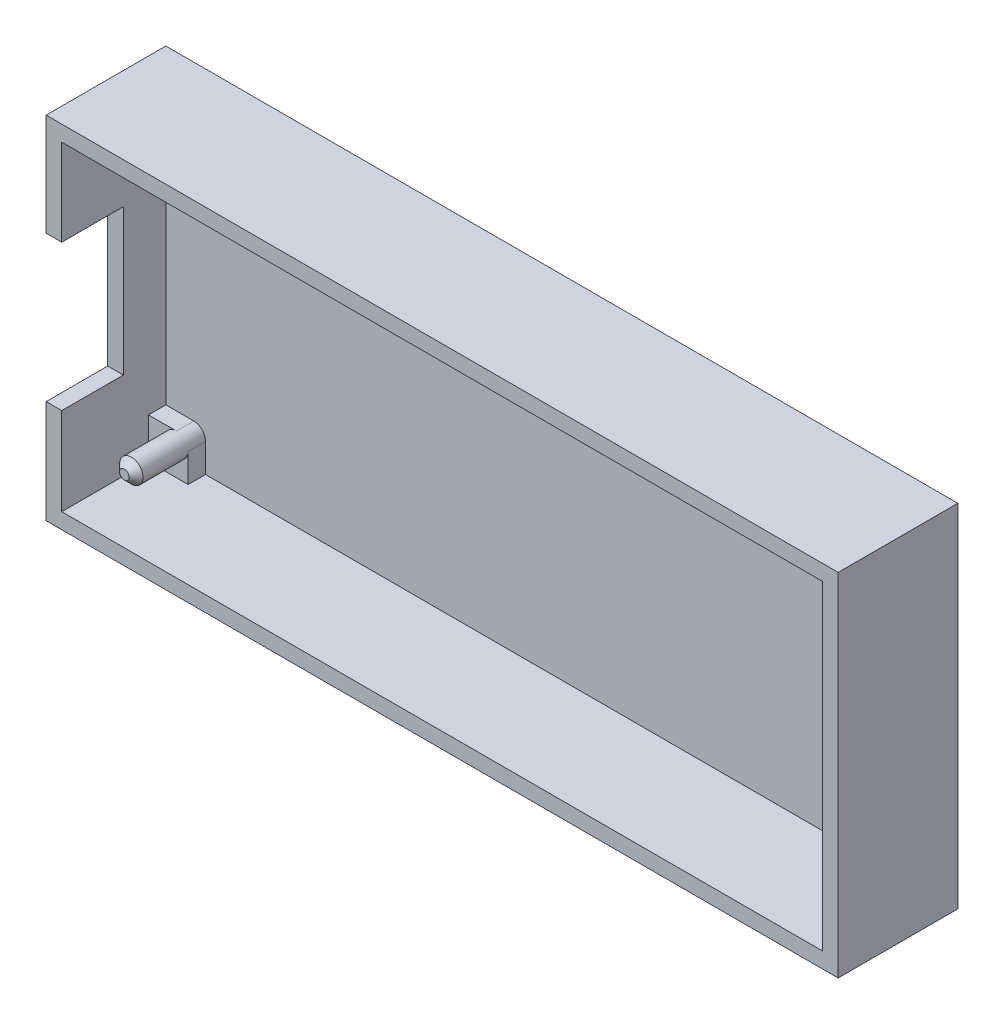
ISO-10303-21;
HEADER;
FILE_DESCRIPTION(('STEP AP214'),'2;1');
FILE_NAME('part.step','',(''),(''),'','','');
FILE_SCHEMA(('AUTOMOTIVE_DESIGN { 1 0 10303 214 1 1 1 1 }'));
ENDSEC;
DATA;
#1=APPLICATION_CONTEXT('core data for automotive mechanical design processes');
#2=APPLICATION_PROTOCOL_DEFINITION('international standard','automotive_design',2000,#1);
#3=PRODUCT_CONTEXT('',#1,'mechanical');
#4=PRODUCT('Part','Part','',(#3));
#5=PRODUCT_RELATED_PRODUCT_CATEGORY('part','',(#4));
#6=PRODUCT_DEFINITION_FORMATION('','',#4);
#7=PRODUCT_DEFINITION_CONTEXT('part definition',#1,'design');
#8=PRODUCT_DEFINITION('design','',#6,#7);
#9=PRODUCT_DEFINITION_SHAPE('','',#8);
#10=(LENGTH_UNIT() NAMED_UNIT(*) SI_UNIT(.MILLI.,.METRE.));
#11=(NAMED_UNIT(*) PLANE_ANGLE_UNIT() SI_UNIT($,.RADIAN.));
#12=(NAMED_UNIT(*) SI_UNIT($,.STERADIAN.) SOLID_ANGLE_UNIT());
#13=UNCERTAINTY_MEASURE_WITH_UNIT(LENGTH_MEASURE(1.E-05),#10,'distance_accuracy_value','');
#14=(GEOMETRIC_REPRESENTATION_CONTEXT(3) GLOBAL_UNCERTAINTY_ASSIGNED_CONTEXT((#13)) GLOBAL_UNIT_ASSIGNED_CONTEXT((#10,
#11,#12)) REPRESENTATION_CONTEXT('',''));
#15=CARTESIAN_POINT('',(0.,0.,0.));
#16=DIRECTION('',(0.,0.,1.));
#17=DIRECTION('',(1.,0.,0.));
#18=AXIS2_PLACEMENT_3D('',#15,#16,#17);
#19=CARTESIAN_POINT('',(0.776564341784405,0.0262590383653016,-0.9));
#20=DIRECTION('',(0.,0.,-1.));
#21=DIRECTION('',(0.,-1.,0.));
#22=AXIS2_PLACEMENT_3D('',#19,#20,#21);
#23=PLANE('',#22);
#24=DIRECTION('',(0.,1.,0.));
#25=VECTOR('',#24,1.);
#26=CARTESIAN_POINT('',(-22.0499995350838,-10.0974817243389,-0.9));
#27=LINE('',#26,#25);
#28=CARTESIAN_POINT('',(-22.0499995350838,-10.0974817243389,-0.9));
#29=VERTEX_POINT('',#28);
#30=CARTESIAN_POINT('',(-22.0499995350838,10.1499998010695,-0.9));
#31=VERTEX_POINT('',#30);
#32=EDGE_CURVE('E11',#29,#31,#27,.T.);
#33=ORIENTED_EDGE('',*,*,#32,.T.);
#34=DIRECTION('',(1.,0.,0.));
#35=VECTOR('',#34,1.);
#36=CARTESIAN_POINT('',(-22.0499995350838,10.1499998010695,-0.9));
#37=LINE('',#36,#35);
#38=CARTESIAN_POINT('',(23.6031282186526,10.1499998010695,-0.9));
#39=VERTEX_POINT('',#38);
#40=EDGE_CURVE('E333',#31,#39,#37,.T.);
#41=ORIENTED_EDGE('',*,*,#40,.T.);
#42=DIRECTION('',(0.,-1.,0.));
#43=VECTOR('',#42,1.);
#44=CARTESIAN_POINT('',(23.6031282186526,10.1499998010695,-0.9));
#45=LINE('',#44,#43);
#46=CARTESIAN_POINT('',(23.6031282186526,-10.0974817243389,-0.9));
#47=VERTEX_POINT('',#46);
#48=EDGE_CURVE('E334',#39,#47,#45,.T.);
#49=ORIENTED_EDGE('',*,*,#48,.T.);
#50=DIRECTION('',(-1.,0.,0.));
#51=VECTOR('',#50,1.);
#52=CARTESIAN_POINT('',(23.6031282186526,-10.0974817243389,-0.9));
#53=LINE('',#52,#51);
#54=EDGE_CURVE('E398',#47,#29,#53,.T.);
#55=ORIENTED_EDGE('',*,*,#54,.T.);
#56=EDGE_LOOP('',(#33,#41,#49,#55));
#57=FACE_BOUND('',#56,.T.);
#58=ADVANCED_FACE('F17',(#57),#23,.T.);
#59=CARTESIAN_POINT('',(-22.0499995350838,-10.0974817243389,0.));
#60=DIRECTION('',(-1.,0.,0.));
#61=DIRECTION('',(0.,0.,1.));
#62=AXIS2_PLACEMENT_3D('',#59,#60,#61);
#63=PLANE('',#62);
#64=DIRECTION('',(0.,0.,1.));
#65=VECTOR('',#64,1.);
#66=CARTESIAN_POINT('',(-22.0499995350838,4.2525697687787,0.));
#67=LINE('',#66,#65);
#68=CARTESIAN_POINT('',(-22.0499995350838,4.2525697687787,2.45));
#69=VERTEX_POINT('',#68);
#70=CARTESIAN_POINT('',(-22.0499995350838,4.2525697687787,6.));
#71=VERTEX_POINT('',#70);
#72=EDGE_CURVE('E452',#69,#71,#67,.T.);
#73=ORIENTED_EDGE('',*,*,#72,.T.);
#74=DIRECTION('',(0.,-1.,0.));
#75=VECTOR('',#74,1.);
#76=CARTESIAN_POINT('',(-22.0499995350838,-10.0974817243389,6.));
#77=LINE('',#76,#75);
#78=CARTESIAN_POINT('',(-22.0499995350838,10.1499998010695,6.));
#79=VERTEX_POINT('',#78);
#80=EDGE_CURVE('E399',#79,#71,#77,.T.);
#81=ORIENTED_EDGE('',*,*,#80,.F.);
#82=DIRECTION('',(0.,0.,-1.));
#83=VECTOR('',#82,1.);
#84=CARTESIAN_POINT('',(-22.0499995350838,10.1499998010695,0.));
#85=LINE('',#84,#83);
#86=EDGE_CURVE('E28',#79,#31,#85,.T.);
#87=ORIENTED_EDGE('',*,*,#86,.T.);
#88=ORIENTED_EDGE('',*,*,#32,.F.);
#89=DIRECTION('',(0.,0.,1.));
#90=VECTOR('',#89,1.);
#91=CARTESIAN_POINT('',(-22.0499995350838,-10.0974817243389,0.));
#92=LINE('',#91,#90);
#93=CARTESIAN_POINT('',(-22.0499995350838,-10.0974817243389,6.));
#94=VERTEX_POINT('',#93);
#95=EDGE_CURVE('E395',#29,#94,#92,.T.);
#96=ORIENTED_EDGE('',*,*,#95,.T.);
#97=DIRECTION('',(0.,-1.,0.));
#98=VECTOR('',#97,1.);
#99=CARTESIAN_POINT('',(-22.0499995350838,-10.0974817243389,6.));
#100=LINE('',#99,#98);
#101=CARTESIAN_POINT('',(-22.0499995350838,-4.14999991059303,6.));
#102=VERTEX_POINT('',#101);
#103=EDGE_CURVE('E498',#102,#94,#100,.T.);
#104=ORIENTED_EDGE('',*,*,#103,.F.);
#105=DIRECTION('',(0.,0.,1.));
#106=VECTOR('',#105,1.);
#107=CARTESIAN_POINT('',(-22.0499995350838,-4.14999991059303,0.));
#108=LINE('',#107,#106);
#109=CARTESIAN_POINT('',(-22.0499995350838,-4.14999991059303,2.45));
#110=VERTEX_POINT('',#109);
#111=EDGE_CURVE('E447',#110,#102,#108,.T.);
#112=ORIENTED_EDGE('',*,*,#111,.F.);
#113=DIRECTION('',(0.,-1.,0.));
#114=VECTOR('',#113,1.);
#115=CARTESIAN_POINT('',(-22.0499995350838,-10.0974817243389,2.45));
#116=LINE('',#115,#114);
#117=EDGE_CURVE('E335',#69,#110,#116,.T.);
#118=ORIENTED_EDGE('',*,*,#117,.F.);
#119=EDGE_LOOP('',(#73,#81,#87,#88,#96,#104,#112,#118));
#120=FACE_BOUND('',#119,.T.);
#121=ADVANCED_FACE('F598',(#120),#63,.T.);
#122=CARTESIAN_POINT('',(-22.0499995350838,10.1499998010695,0.));
#123=DIRECTION('',(0.,1.,0.));
#124=DIRECTION('',(1.,0.,0.));
#125=AXIS2_PLACEMENT_3D('',#122,#123,#124);
#126=PLANE('',#125);
#127=DIRECTION('',(0.,0.,1.));
#128=VECTOR('',#127,1.);
#129=CARTESIAN_POINT('',(23.6031282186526,10.1499998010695,0.));
#130=LINE('',#129,#128);
#131=CARTESIAN_POINT('',(23.6031282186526,10.1499998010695,6.));
#132=VERTEX_POINT('',#131);
#133=EDGE_CURVE('E329',#39,#132,#130,.T.);
#134=ORIENTED_EDGE('',*,*,#133,.F.);
#135=ORIENTED_EDGE('',*,*,#40,.F.);
#136=ORIENTED_EDGE('',*,*,#86,.F.);
#137=DIRECTION('',(-1.,0.,0.));
#138=VECTOR('',#137,1.);
#139=CARTESIAN_POINT('',(-22.0499995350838,10.1499998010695,6.));
#140=LINE('',#139,#138);
#141=EDGE_CURVE('E503',#132,#79,#140,.T.);
#142=ORIENTED_EDGE('',*,*,#141,.F.);
#143=EDGE_LOOP('',(#134,#135,#136,#142));
#144=FACE_BOUND('',#143,.T.);
#145=ADVANCED_FACE('F603',(#144),#126,.T.);
#146=CARTESIAN_POINT('',(23.6031282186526,10.1499998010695,0.));
#147=DIRECTION('',(1.,0.,0.));
#148=DIRECTION('',(0.,-1.,0.));
#149=AXIS2_PLACEMENT_3D('',#146,#147,#148);
#150=PLANE('',#149);
#151=DIRECTION('',(0.,0.,1.));
#152=VECTOR('',#151,1.);
#153=CARTESIAN_POINT('',(23.6031282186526,-10.0974817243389,0.));
#154=LINE('',#153,#152);
#155=CARTESIAN_POINT('',(23.6031282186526,-10.0974817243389,6.));
#156=VERTEX_POINT('',#155);
#157=EDGE_CURVE('E470',#47,#156,#154,.T.);
#158=ORIENTED_EDGE('',*,*,#157,.F.);
#159=ORIENTED_EDGE('',*,*,#48,.F.);
#160=ORIENTED_EDGE('',*,*,#133,.T.);
#161=DIRECTION('',(0.,1.,0.));
#162=VECTOR('',#161,1.);
#163=CARTESIAN_POINT('',(23.6031282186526,10.1499998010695,6.));
#164=LINE('',#163,#162);
#165=EDGE_CURVE('E497',#156,#132,#164,.T.);
#166=ORIENTED_EDGE('',*,*,#165,.F.);
#167=EDGE_LOOP('',(#158,#159,#160,#166));
#168=FACE_BOUND('',#167,.T.);
#169=ADVANCED_FACE('F19',(#168),#150,.T.);
#170=CARTESIAN_POINT('',(23.6031282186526,-10.0974817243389,0.));
#171=DIRECTION('',(0.,-1.,0.));
#172=DIRECTION('',(-1.,0.,0.));
#173=AXIS2_PLACEMENT_3D('',#170,#171,#172);
#174=PLANE('',#173);
#175=ORIENTED_EDGE('',*,*,#95,.F.);
#176=ORIENTED_EDGE('',*,*,#54,.F.);
#177=ORIENTED_EDGE('',*,*,#157,.T.);
#178=DIRECTION('',(1.,0.,0.));
#179=VECTOR('',#178,1.);
#180=CARTESIAN_POINT('',(23.6031282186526,-10.0974817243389,6.));
#181=LINE('',#180,#179);
#182=EDGE_CURVE('E493',#94,#156,#181,.T.);
#183=ORIENTED_EDGE('',*,*,#182,.F.);
#184=EDGE_LOOP('',(#175,#176,#177,#183));
#185=FACE_BOUND('',#184,.T.);
#186=ADVANCED_FACE('F610',(#185),#174,.T.);
#187=CARTESIAN_POINT('',(0.776564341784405,0.0262590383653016,6.));
#188=DIRECTION('',(0.,0.,1.));
#189=DIRECTION('',(1.,0.,0.));
#190=AXIS2_PLACEMENT_3D('',#187,#188,#189);
#191=PLANE('',#190);
#192=DIRECTION('',(-1.,0.,0.));
#193=VECTOR('',#192,1.);
#194=CARTESIAN_POINT('',(22.7031282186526,-9.1974817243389,6.));
#195=LINE('',#194,#193);
#196=CARTESIAN_POINT('',(22.7031282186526,-9.1974817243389,6.));
#197=VERTEX_POINT('',#196);
#198=CARTESIAN_POINT('',(-21.1499995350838,-9.1974817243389,6.));
#199=VERTEX_POINT('',#198);
#200=EDGE_CURVE('E518',#197,#199,#195,.T.);
#201=ORIENTED_EDGE('',*,*,#200,.T.);
#202=DIRECTION('',(0.,1.,0.));
#203=VECTOR('',#202,1.);
#204=CARTESIAN_POINT('',(-21.1499995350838,-9.1974817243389,6.));
#205=LINE('',#204,#203);
#206=CARTESIAN_POINT('',(-21.1499995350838,-4.14999991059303,6.));
#207=VERTEX_POINT('',#206);
#208=EDGE_CURVE('E537',#199,#207,#205,.T.);
#209=ORIENTED_EDGE('',*,*,#208,.T.);
#210=DIRECTION('',(-1.,0.,0.));
#211=VECTOR('',#210,1.);
#212=CARTESIAN_POINT('',(-22.4499995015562,-4.14999991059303,6.));
#213=LINE('',#212,#211);
#214=EDGE_CURVE('E451',#207,#102,#213,.T.);
#215=ORIENTED_EDGE('',*,*,#214,.T.);
#216=ORIENTED_EDGE('',*,*,#103,.T.);
#217=ORIENTED_EDGE('',*,*,#182,.T.);
#218=ORIENTED_EDGE('',*,*,#165,.T.);
#219=ORIENTED_EDGE('',*,*,#141,.T.);
#220=ORIENTED_EDGE('',*,*,#80,.T.);
#221=DIRECTION('',(1.,0.,0.));
#222=VECTOR('',#221,1.);
#223=CARTESIAN_POINT('',(-16.5093841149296,4.2525697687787,6.));
#224=LINE('',#223,#222);
#225=CARTESIAN_POINT('',(-21.1499995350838,4.2525697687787,6.));
#226=VERTEX_POINT('',#225);
#227=EDGE_CURVE('E339',#71,#226,#224,.T.);
#228=ORIENTED_EDGE('',*,*,#227,.T.);
#229=DIRECTION('',(0.,1.,0.));
#230=VECTOR('',#229,1.);
#231=CARTESIAN_POINT('',(-21.1499995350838,-9.19748172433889,6.));
#232=LINE('',#231,#230);
#233=CARTESIAN_POINT('',(-21.1499995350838,9.2499998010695,6.));
#234=VERTEX_POINT('',#233);
#235=EDGE_CURVE('E437',#226,#234,#232,.T.);
#236=ORIENTED_EDGE('',*,*,#235,.T.);
#237=DIRECTION('',(1.,0.,0.));
#238=VECTOR('',#237,1.);
#239=CARTESIAN_POINT('',(-21.1499995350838,9.2499998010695,6.));
#240=LINE('',#239,#238);
#241=CARTESIAN_POINT('',(22.7031282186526,9.2499998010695,6.));
#242=VERTEX_POINT('',#241);
#243=EDGE_CURVE('E433',#234,#242,#240,.T.);
#244=ORIENTED_EDGE('',*,*,#243,.T.);
#245=DIRECTION('',(0.,-1.,0.));
#246=VECTOR('',#245,1.);
#247=CARTESIAN_POINT('',(22.7031282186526,9.2499998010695,6.));
#248=LINE('',#247,#246);
#249=EDGE_CURVE('E511',#242,#197,#248,.T.);
#250=ORIENTED_EDGE('',*,*,#249,.T.);
#251=EDGE_LOOP('',(#201,#209,#215,#216,#217,#218,#219,#220,#228,#236,#244,#250));
#252=FACE_BOUND('',#251,.T.);
#253=ADVANCED_FACE('F613',(#252),#191,.T.);
#254=CARTESIAN_POINT('',(-21.1499995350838,-4.14999991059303,0.));
#255=DIRECTION('',(0.,1.,0.));
#256=DIRECTION('',(1.,0.,0.));
#257=AXIS2_PLACEMENT_3D('',#254,#255,#256);
#258=PLANE('',#257);
#259=DIRECTION('',(-1.,0.,0.));
#260=VECTOR('',#259,1.);
#261=CARTESIAN_POINT('',(-21.3749995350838,-4.14999991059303,2.45));
#262=LINE('',#261,#260);
#263=CARTESIAN_POINT('',(-21.1499995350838,-4.14999991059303,2.45));
#264=VERTEX_POINT('',#263);
#265=EDGE_CURVE('E415',#264,#110,#262,.T.);
#266=ORIENTED_EDGE('',*,*,#265,.T.);
#267=ORIENTED_EDGE('',*,*,#111,.T.);
#268=ORIENTED_EDGE('',*,*,#214,.F.);
#269=DIRECTION('',(0.,0.,1.));
#270=VECTOR('',#269,1.);
#271=CARTESIAN_POINT('',(-21.1499995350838,-4.14999991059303,0.));
#272=LINE('',#271,#270);
#273=EDGE_CURVE('E533',#264,#207,#272,.T.);
#274=ORIENTED_EDGE('',*,*,#273,.F.);
#275=EDGE_LOOP('',(#266,#267,#268,#274));
#276=FACE_BOUND('',#275,.T.);
#277=ADVANCED_FACE('F623',(#276),#258,.T.);
#278=CARTESIAN_POINT('',(-22.0499995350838,4.2525697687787,0.));
#279=DIRECTION('',(0.,-1.,0.));
#280=DIRECTION('',(0.,0.,-1.));
#281=AXIS2_PLACEMENT_3D('',#278,#279,#280);
#282=PLANE('',#281);
#283=DIRECTION('',(1.,0.,0.));
#284=VECTOR('',#283,1.);
#285=CARTESIAN_POINT('',(-21.8249995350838,4.2525697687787,2.45));
#286=LINE('',#285,#284);
#287=CARTESIAN_POINT('',(-21.1499995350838,4.2525697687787,2.45));
#288=VERTEX_POINT('',#287);
#289=EDGE_CURVE('E340',#69,#288,#286,.T.);
#290=ORIENTED_EDGE('',*,*,#289,.T.);
#291=DIRECTION('',(0.,0.,1.));
#292=VECTOR('',#291,1.);
#293=CARTESIAN_POINT('',(-21.1499995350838,4.2525697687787,0.));
#294=LINE('',#293,#292);
#295=EDGE_CURVE('E701',#288,#226,#294,.T.);
#296=ORIENTED_EDGE('',*,*,#295,.T.);
#297=ORIENTED_EDGE('',*,*,#227,.F.);
#298=ORIENTED_EDGE('',*,*,#72,.F.);
#299=EDGE_LOOP('',(#290,#296,#297,#298));
#300=FACE_BOUND('',#299,.T.);
#301=ADVANCED_FACE('F592',(#300),#282,.T.);
#302=CARTESIAN_POINT('',(-21.5999995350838,0.0512849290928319,2.45));
#303=DIRECTION('',(0.,0.,1.));
#304=DIRECTION('',(1.,0.,0.));
#305=AXIS2_PLACEMENT_3D('',#302,#303,#304);
#306=PLANE('',#305);
#307=ORIENTED_EDGE('',*,*,#265,.F.);
#308=DIRECTION('',(0.,1.,0.));
#309=VECTOR('',#308,1.);
#310=CARTESIAN_POINT('',(-21.1499995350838,-9.19748172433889,2.45));
#311=LINE('',#310,#309);
#312=EDGE_CURVE('E538',#264,#288,#311,.T.);
#313=ORIENTED_EDGE('',*,*,#312,.T.);
#314=ORIENTED_EDGE('',*,*,#289,.F.);
#315=ORIENTED_EDGE('',*,*,#117,.T.);
#316=EDGE_LOOP('',(#307,#313,#314,#315));
#317=FACE_BOUND('',#316,.T.);
#318=ADVANCED_FACE('F583',(#317),#306,.T.);
#319=CARTESIAN_POINT('',(-19.5392621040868,7.65981656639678,4.));
#320=DIRECTION('',(0.,0.,1.));
#321=DIRECTION('',(1.,0.,0.));
#322=AXIS2_PLACEMENT_3D('',#319,#320,#321);
#323=PLANE('',#322);
#324=CARTESIAN_POINT('',(-19.5392621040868,7.65981656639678,4.));
#325=DIRECTION('',(0.,0.,-1.));
#326=DIRECTION('',(1.,0.,0.));
#327=AXIS2_PLACEMENT_3D('',#324,#325,#326);
#328=CIRCLE('',#327,0.275545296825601);
#329=CARTESIAN_POINT('',(-19.8148074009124,7.65981656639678,4.));
#330=VERTEX_POINT('',#329);
#331=EDGE_CURVE('E416',#330,#330,#328,.T.);
#332=ORIENTED_EDGE('',*,*,#331,.F.);
#333=EDGE_LOOP('',(#332));
#334=FACE_BOUND('',#333,.T.);
#335=ADVANCED_FACE('F581',(#334),#323,.T.);
#336=CARTESIAN_POINT('',(-19.5392621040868,7.65981656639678,3.8));
#337=DIRECTION('',(0.,0.,-1.));
#338=DIRECTION('',(1.,0.,0.));
#339=AXIS2_PLACEMENT_3D('',#336,#337,#338);
#340=CONICAL_SURFACE('',#339,0.475545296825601,0.785398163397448);
#341=ORIENTED_EDGE('',*,*,#331,.T.);
#342=DIRECTION('',(-0.707106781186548,0.,-0.707106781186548));
#343=VECTOR('',#342,1.);
#344=CARTESIAN_POINT('',(-20.0148074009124,7.65981656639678,3.8));
#345=LINE('',#344,#343);
#346=CARTESIAN_POINT('',(-20.2148074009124,7.65981656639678,3.6));
#347=VERTEX_POINT('',#346);
#348=EDGE_CURVE('E412',#330,#347,#345,.T.);
#349=ORIENTED_EDGE('',*,*,#348,.T.);
#350=CARTESIAN_POINT('',(-19.5392621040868,7.65981656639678,3.6));
#351=DIRECTION('',(0.,0.,1.));
#352=DIRECTION('',(1.,0.,0.));
#353=AXIS2_PLACEMENT_3D('',#350,#351,#352);
#354=CIRCLE('',#353,0.675545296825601);
#355=EDGE_CURVE('E428',#347,#347,#354,.T.);
#356=ORIENTED_EDGE('',*,*,#355,.T.);
#357=ORIENTED_EDGE('',*,*,#348,.F.);
#358=EDGE_LOOP('',(#341,#349,#356,#357));
#359=FACE_BOUND('',#358,.T.);
#360=ADVANCED_FACE('F578',(#359),#340,.T.);
#361=CARTESIAN_POINT('',(-19.5392621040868,-7.54018343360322,4.));
#362=DIRECTION('',(0.,0.,1.));
#363=DIRECTION('',(1.,0.,0.));
#364=AXIS2_PLACEMENT_3D('',#361,#362,#363);
#365=PLANE('',#364);
#366=CARTESIAN_POINT('',(-19.5392621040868,-7.54018343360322,4.));
#367=DIRECTION('',(0.,0.,-1.));
#368=DIRECTION('',(1.,0.,0.));
#369=AXIS2_PLACEMENT_3D('',#366,#367,#368);
#370=CIRCLE('',#369,0.275545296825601);
#371=CARTESIAN_POINT('',(-19.8148074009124,-7.54018343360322,4.));
#372=VERTEX_POINT('',#371);
#373=EDGE_CURVE('E462',#372,#372,#370,.T.);
#374=ORIENTED_EDGE('',*,*,#373,.F.);
#375=EDGE_LOOP('',(#374));
#376=FACE_BOUND('',#375,.T.);
#377=ADVANCED_FACE('F590',(#376),#365,.T.);
#378=CARTESIAN_POINT('',(-19.5392621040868,-7.54018343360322,3.8));
#379=DIRECTION('',(0.,0.,-1.));
#380=DIRECTION('',(1.,0.,0.));
#381=AXIS2_PLACEMENT_3D('',#378,#379,#380);
#382=CONICAL_SURFACE('',#381,0.475545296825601,0.785398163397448);
#383=ORIENTED_EDGE('',*,*,#373,.T.);
#384=DIRECTION('',(-0.707106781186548,0.,-0.707106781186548));
#385=VECTOR('',#384,1.);
#386=CARTESIAN_POINT('',(-20.0148074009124,-7.54018343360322,3.8));
#387=LINE('',#386,#385);
#388=CARTESIAN_POINT('',(-20.2148074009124,-7.54018343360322,3.6));
#389=VERTEX_POINT('',#388);
#390=EDGE_CURVE('E466',#372,#389,#387,.T.);
#391=ORIENTED_EDGE('',*,*,#390,.T.);
#392=CARTESIAN_POINT('',(-19.5392621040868,-7.54018343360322,3.6));
#393=DIRECTION('',(0.,0.,1.));
#394=DIRECTION('',(1.,0.,0.));
#395=AXIS2_PLACEMENT_3D('',#392,#393,#394);
#396=CIRCLE('',#395,0.675545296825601);
#397=EDGE_CURVE('E562',#389,#389,#396,.T.);
#398=ORIENTED_EDGE('',*,*,#397,.T.);
#399=ORIENTED_EDGE('',*,*,#390,.F.);
#400=EDGE_LOOP('',(#383,#391,#398,#399));
#401=FACE_BOUND('',#400,.T.);
#402=ADVANCED_FACE('F647',(#401),#382,.T.);
#403=CARTESIAN_POINT('',(21.1107378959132,7.65981656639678,2.));
#404=DIRECTION('',(0.,0.,1.));
#405=DIRECTION('',(1.,0.,0.));
#406=AXIS2_PLACEMENT_3D('',#403,#404,#405);
#407=PLANE('',#406);
#408=CARTESIAN_POINT('',(21.1107378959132,7.65981656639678,2.));
#409=DIRECTION('',(0.,0.,-1.));
#410=DIRECTION('',(1.,0.,0.));
#411=AXIS2_PLACEMENT_3D('',#408,#409,#410);
#412=CIRCLE('',#411,0.275545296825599);
#413=CARTESIAN_POINT('',(20.8351925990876,7.65981656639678,2.));
#414=VERTEX_POINT('',#413);
#415=EDGE_CURVE('E312',#414,#414,#412,.T.);
#416=ORIENTED_EDGE('',*,*,#415,.F.);
#417=EDGE_LOOP('',(#416));
#418=FACE_BOUND('',#417,.T.);
#419=ADVANCED_FACE('F608',(#418),#407,.T.);
#420=CARTESIAN_POINT('',(21.1107378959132,7.65981656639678,0.));
#421=DIRECTION('',(0.,0.,1.));
#422=DIRECTION('',(1.,0.,0.));
#423=AXIS2_PLACEMENT_3D('',#420,#421,#422);
#424=CYLINDRICAL_SURFACE('',#423,0.675545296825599);
#425=CARTESIAN_POINT('',(21.1107378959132,7.65981656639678,1.6));
#426=DIRECTION('',(0.,0.,1.));
#427=DIRECTION('',(1.,0.,0.));
#428=AXIS2_PLACEMENT_3D('',#425,#426,#427);
#429=CIRCLE('',#428,0.675545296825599);
#430=CARTESIAN_POINT('',(20.4351925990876,7.65981656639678,1.6));
#431=VERTEX_POINT('',#430);
#432=EDGE_CURVE('E480',#431,#431,#429,.T.);
#433=ORIENTED_EDGE('',*,*,#432,.F.);
#434=DIRECTION('',(0.,0.,-1.));
#435=VECTOR('',#434,1.);
#436=CARTESIAN_POINT('',(20.4351925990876,7.65981656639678,0.));
#437=LINE('',#436,#435);
#438=CARTESIAN_POINT('',(20.4351925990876,7.65981656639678,1.));
#439=VERTEX_POINT('',#438);
#440=EDGE_CURVE('E467',#431,#439,#437,.T.);
#441=ORIENTED_EDGE('',*,*,#440,.T.);
#442=DIRECTION('',(0.,0.,1.));
#443=VECTOR('',#442,1.);
#444=CARTESIAN_POINT('',(20.4351925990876,7.65981656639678,0.));
#445=LINE('',#444,#443);
#446=CARTESIAN_POINT('',(20.4351925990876,7.65981656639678,0.));
#447=VERTEX_POINT('',#446);
#448=EDGE_CURVE('E442',#447,#439,#445,.T.);
#449=ORIENTED_EDGE('',*,*,#448,.F.);
#450=CARTESIAN_POINT('',(21.1107378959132,7.65981656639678,0.));
#451=DIRECTION('',(0.,0.,-1.));
#452=DIRECTION('',(1.,0.,0.));
#453=AXIS2_PLACEMENT_3D('',#450,#451,#452);
#454=CIRCLE('',#453,0.675545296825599);
#455=CARTESIAN_POINT('',(21.1107378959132,6.98427126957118,0.));
#456=VERTEX_POINT('',#455);
#457=EDGE_CURVE('E346',#456,#447,#454,.T.);
#458=ORIENTED_EDGE('',*,*,#457,.F.);
#459=DIRECTION('',(0.,0.,1.));
#460=VECTOR('',#459,1.);
#461=CARTESIAN_POINT('',(21.1107378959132,6.98427126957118,0.));
#462=LINE('',#461,#460);
#463=CARTESIAN_POINT('',(21.1107378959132,6.98427126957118,1.));
#464=VERTEX_POINT('',#463);
#465=EDGE_CURVE('E777',#456,#464,#462,.T.);
#466=ORIENTED_EDGE('',*,*,#465,.T.);
#467=CARTESIAN_POINT('',(21.1107378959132,7.65981656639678,1.));
#468=DIRECTION('',(0.,0.,1.));
#469=DIRECTION('',(1.,0.,0.));
#470=AXIS2_PLACEMENT_3D('',#467,#468,#469);
#471=CIRCLE('',#470,0.675545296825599);
#472=EDGE_CURVE('E507',#464,#439,#471,.T.);
#473=ORIENTED_EDGE('',*,*,#472,.T.);
#474=ORIENTED_EDGE('',*,*,#440,.F.);
#475=EDGE_LOOP('',(#433,#441,#449,#458,#466,#473,#474));
#476=FACE_BOUND('',#475,.T.);
#477=ADVANCED_FACE('F629',(#476),#424,.T.);
#478=CARTESIAN_POINT('',(21.1107378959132,7.65981656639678,1.8));
#479=DIRECTION('',(0.,0.,-1.));
#480=DIRECTION('',(1.,0.,0.));
#481=AXIS2_PLACEMENT_3D('',#478,#479,#480);
#482=CONICAL_SURFACE('',#481,0.475545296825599,0.785398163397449);
#483=ORIENTED_EDGE('',*,*,#415,.T.);
#484=DIRECTION('',(-0.707106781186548,0.,-0.707106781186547));
#485=VECTOR('',#484,1.);
#486=CARTESIAN_POINT('',(20.6351925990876,7.65981656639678,1.8));
#487=LINE('',#486,#485);
#488=EDGE_CURVE('E411',#414,#431,#487,.T.);
#489=ORIENTED_EDGE('',*,*,#488,.T.);
#490=ORIENTED_EDGE('',*,*,#432,.T.);
#491=ORIENTED_EDGE('',*,*,#488,.F.);
#492=EDGE_LOOP('',(#483,#489,#490,#491));
#493=FACE_BOUND('',#492,.T.);
#494=ADVANCED_FACE('F625',(#493),#482,.T.);
#495=CARTESIAN_POINT('',(21.1107378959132,-7.54018343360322,2.));
#496=DIRECTION('',(0.,0.,1.));
#497=DIRECTION('',(1.,0.,0.));
#498=AXIS2_PLACEMENT_3D('',#495,#496,#497);
#499=PLANE('',#498);
#500=CARTESIAN_POINT('',(21.1107378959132,-7.54018343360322,2.));
#501=DIRECTION('',(0.,0.,-1.));
#502=DIRECTION('',(1.,0.,0.));
#503=AXIS2_PLACEMENT_3D('',#500,#501,#502);
#504=CIRCLE('',#503,0.275545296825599);
#505=CARTESIAN_POINT('',(20.8351925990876,-7.54018343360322,2.));
#506=VERTEX_POINT('',#505);
#507=EDGE_CURVE('E323',#506,#506,#504,.T.);
#508=ORIENTED_EDGE('',*,*,#507,.F.);
#509=EDGE_LOOP('',(#508));
#510=FACE_BOUND('',#509,.T.);
#511=ADVANCED_FACE('F628',(#510),#499,.T.);
#512=CARTESIAN_POINT('',(21.1107378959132,-7.54018343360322,0.));
#513=DIRECTION('',(0.,0.,1.));
#514=DIRECTION('',(1.,0.,0.));
#515=AXIS2_PLACEMENT_3D('',#512,#513,#514);
#516=CYLINDRICAL_SURFACE('',#515,0.675545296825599);
#517=CARTESIAN_POINT('',(21.1107378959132,-7.54018343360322,1.6));
#518=DIRECTION('',(0.,0.,1.));
#519=DIRECTION('',(1.,0.,0.));
#520=AXIS2_PLACEMENT_3D('',#517,#518,#519);
#521=CIRCLE('',#520,0.675545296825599);
#522=CARTESIAN_POINT('',(20.4351925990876,-7.54018343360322,1.6));
#523=VERTEX_POINT('',#522);
#524=EDGE_CURVE('E305',#523,#523,#521,.T.);
#525=ORIENTED_EDGE('',*,*,#524,.F.);
#526=DIRECTION('',(0.,0.,-1.));
#527=VECTOR('',#526,1.);
#528=CARTESIAN_POINT('',(20.4351925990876,-7.54018343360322,0.));
#529=LINE('',#528,#527);
#530=CARTESIAN_POINT('',(20.4351925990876,-7.54018343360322,1.));
#531=VERTEX_POINT('',#530);
#532=EDGE_CURVE('E302',#523,#531,#529,.T.);
#533=ORIENTED_EDGE('',*,*,#532,.T.);
#534=CARTESIAN_POINT('',(21.1107378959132,-7.54018343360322,1.));
#535=DIRECTION('',(0.,0.,1.));
#536=DIRECTION('',(1.,0.,0.));
#537=AXIS2_PLACEMENT_3D('',#534,#535,#536);
#538=CIRCLE('',#537,0.675545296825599);
#539=CARTESIAN_POINT('',(21.1107378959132,-6.86463813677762,1.));
#540=VERTEX_POINT('',#539);
#541=EDGE_CURVE('E381',#531,#540,#538,.T.);
#542=ORIENTED_EDGE('',*,*,#541,.T.);
#543=DIRECTION('',(0.,0.,1.));
#544=VECTOR('',#543,1.);
#545=CARTESIAN_POINT('',(21.1107378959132,-6.86463813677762,0.));
#546=LINE('',#545,#544);
#547=CARTESIAN_POINT('',(21.1107378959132,-6.86463813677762,0.));
#548=VERTEX_POINT('',#547);
#549=EDGE_CURVE('E377',#548,#540,#546,.T.);
#550=ORIENTED_EDGE('',*,*,#549,.F.);
#551=CARTESIAN_POINT('',(21.1107378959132,-7.54018343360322,0.));
#552=DIRECTION('',(0.,0.,-1.));
#553=DIRECTION('',(1.,0.,0.));
#554=AXIS2_PLACEMENT_3D('',#551,#552,#553);
#555=CIRCLE('',#554,0.675545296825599);
#556=CARTESIAN_POINT('',(20.4351925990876,-7.54018343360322,0.));
#557=VERTEX_POINT('',#556);
#558=EDGE_CURVE('E383',#557,#548,#555,.T.);
#559=ORIENTED_EDGE('',*,*,#558,.F.);
#560=DIRECTION('',(0.,0.,1.));
#561=VECTOR('',#560,1.);
#562=CARTESIAN_POINT('',(20.4351925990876,-7.54018343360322,0.));
#563=LINE('',#562,#561);
#564=EDGE_CURVE('E308',#557,#531,#563,.T.);
#565=ORIENTED_EDGE('',*,*,#564,.T.);
#566=ORIENTED_EDGE('',*,*,#532,.F.);
#567=EDGE_LOOP('',(#525,#533,#542,#550,#559,#565,#566));
#568=FACE_BOUND('',#567,.T.);
#569=ADVANCED_FACE('F304',(#568),#516,.T.);
#570=CARTESIAN_POINT('',(21.1107378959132,-7.54018343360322,1.8));
#571=DIRECTION('',(0.,0.,-1.));
#572=DIRECTION('',(1.,0.,0.));
#573=AXIS2_PLACEMENT_3D('',#570,#571,#572);
#574=CONICAL_SURFACE('',#573,0.475545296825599,0.785398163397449);
#575=ORIENTED_EDGE('',*,*,#507,.T.);
#576=DIRECTION('',(-0.707106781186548,0.,-0.707106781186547));
#577=VECTOR('',#576,1.);
#578=CARTESIAN_POINT('',(20.6351925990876,-7.54018343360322,1.8));
#579=LINE('',#578,#577);
#580=EDGE_CURVE('E317',#506,#523,#579,.T.);
#581=ORIENTED_EDGE('',*,*,#580,.T.);
#582=ORIENTED_EDGE('',*,*,#524,.T.);
#583=ORIENTED_EDGE('',*,*,#580,.F.);
#584=EDGE_LOOP('',(#575,#581,#582,#583));
#585=FACE_BOUND('',#584,.T.);
#586=ADVANCED_FACE('F316',(#585),#574,.T.);
#587=CARTESIAN_POINT('',(22.7031282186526,9.2499998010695,0.));
#588=DIRECTION('',(-1.,0.,0.));
#589=DIRECTION('',(0.,0.,1.));
#590=AXIS2_PLACEMENT_3D('',#587,#588,#589);
#591=PLANE('',#590);
#592=DIRECTION('',(0.,-1.,0.));
#593=VECTOR('',#592,1.);
#594=CARTESIAN_POINT('',(22.7031282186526,0.60946993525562,1.));
#595=LINE('',#594,#593);
#596=CARTESIAN_POINT('',(22.7031282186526,-6.86463813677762,1.));
#597=VERTEX_POINT('',#596);
#598=CARTESIAN_POINT('',(22.7031282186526,-9.1974817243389,1.));
#599=VERTEX_POINT('',#598);
#600=EDGE_CURVE('E378',#597,#599,#595,.T.);
#601=ORIENTED_EDGE('',*,*,#600,.T.);
#602=DIRECTION('',(0.,0.,1.));
#603=VECTOR('',#602,1.);
#604=CARTESIAN_POINT('',(22.7031282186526,-9.1974817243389,0.));
#605=LINE('',#604,#603);
#606=EDGE_CURVE('E152',#599,#197,#605,.T.);
#607=ORIENTED_EDGE('',*,*,#606,.T.);
#608=ORIENTED_EDGE('',*,*,#249,.F.);
#609=DIRECTION('',(0.,0.,1.));
#610=VECTOR('',#609,1.);
#611=CARTESIAN_POINT('',(22.7031282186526,9.2499998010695,0.));
#612=LINE('',#611,#610);
#613=CARTESIAN_POINT('',(22.7031282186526,9.2499998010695,1.));
#614=VERTEX_POINT('',#613);
#615=EDGE_CURVE('E526',#614,#242,#612,.T.);
#616=ORIENTED_EDGE('',*,*,#615,.F.);
#617=DIRECTION('',(0.,-1.,0.));
#618=VECTOR('',#617,1.);
#619=CARTESIAN_POINT('',(22.7031282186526,8.68356766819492,1.));
#620=LINE('',#619,#618);
#621=CARTESIAN_POINT('',(22.7031282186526,6.98427126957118,1.));
#622=VERTEX_POINT('',#621);
#623=EDGE_CURVE('E512',#614,#622,#620,.T.);
#624=ORIENTED_EDGE('',*,*,#623,.T.);
#625=DIRECTION('',(0.,0.,-1.));
#626=VECTOR('',#625,1.);
#627=CARTESIAN_POINT('',(22.7031282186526,6.98427126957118,0.));
#628=LINE('',#627,#626);
#629=CARTESIAN_POINT('',(22.7031282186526,6.98427126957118,0.));
#630=VERTEX_POINT('',#629);
#631=EDGE_CURVE('E789',#622,#630,#628,.T.);
#632=ORIENTED_EDGE('',*,*,#631,.T.);
#633=DIRECTION('',(0.,1.,0.));
#634=VECTOR('',#633,1.);
#635=CARTESIAN_POINT('',(22.7031282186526,4.6381294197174,0.));
#636=LINE('',#635,#634);
#637=CARTESIAN_POINT('',(22.7031282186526,-6.86463813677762,0.));
#638=VERTEX_POINT('',#637);
#639=EDGE_CURVE('E386',#638,#630,#636,.T.);
#640=ORIENTED_EDGE('',*,*,#639,.F.);
#641=DIRECTION('',(0.,0.,1.));
#642=VECTOR('',#641,1.);
#643=CARTESIAN_POINT('',(22.7031282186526,-6.86463813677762,0.));
#644=LINE('',#643,#642);
#645=EDGE_CURVE('E354',#638,#597,#644,.T.);
#646=ORIENTED_EDGE('',*,*,#645,.T.);
#647=EDGE_LOOP('',(#601,#607,#608,#616,#624,#632,#640,#646));
#648=FACE_BOUND('',#647,.T.);
#649=ADVANCED_FACE('F664',(#648),#591,.T.);
#650=CARTESIAN_POINT('',(21.5691604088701,8.11713553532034,1.));
#651=DIRECTION('',(0.,0.,1.));
#652=DIRECTION('',(1.,0.,0.));
#653=AXIS2_PLACEMENT_3D('',#650,#651,#652);
#654=PLANE('',#653);
#655=DIRECTION('',(1.,0.,0.));
#656=VECTOR('',#655,1.);
#657=CARTESIAN_POINT('',(22.7031282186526,6.98427126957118,1.));
#658=LINE('',#657,#656);
#659=EDGE_CURVE('E781',#464,#622,#658,.T.);
#660=ORIENTED_EDGE('',*,*,#659,.T.);
#661=ORIENTED_EDGE('',*,*,#623,.F.);
#662=DIRECTION('',(1.,0.,0.));
#663=VECTOR('',#662,1.);
#664=CARTESIAN_POINT('',(0.20958043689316,9.2499998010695,1.));
#665=LINE('',#664,#663);
#666=CARTESIAN_POINT('',(20.4351925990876,9.2499998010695,1.));
#667=VERTEX_POINT('',#666);
#668=EDGE_CURVE('E522',#667,#614,#665,.T.);
#669=ORIENTED_EDGE('',*,*,#668,.F.);
#670=DIRECTION('',(0.,-1.,0.));
#671=VECTOR('',#670,1.);
#672=CARTESIAN_POINT('',(20.4351925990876,6.98427126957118,1.));
#673=LINE('',#672,#671);
#674=EDGE_CURVE('E446',#667,#439,#673,.T.);
#675=ORIENTED_EDGE('',*,*,#674,.T.);
#676=ORIENTED_EDGE('',*,*,#472,.F.);
#677=EDGE_LOOP('',(#660,#661,#669,#675,#676));
#678=FACE_BOUND('',#677,.T.);
#679=ADVANCED_FACE('F619',(#678),#654,.T.);
#680=CARTESIAN_POINT('',(21.1107378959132,6.98427126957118,0.));
#681=DIRECTION('',(0.,-1.,0.));
#682=DIRECTION('',(0.,0.,-1.));
#683=AXIS2_PLACEMENT_3D('',#680,#681,#682);
#684=PLANE('',#683);
#685=DIRECTION('',(-1.,0.,0.));
#686=VECTOR('',#685,1.);
#687=CARTESIAN_POINT('',(10.9436511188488,6.98427126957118,0.));
#688=LINE('',#687,#686);
#689=EDGE_CURVE('E548',#630,#456,#688,.T.);
#690=ORIENTED_EDGE('',*,*,#689,.F.);
#691=ORIENTED_EDGE('',*,*,#631,.F.);
#692=ORIENTED_EDGE('',*,*,#659,.F.);
#693=ORIENTED_EDGE('',*,*,#465,.F.);
#694=EDGE_LOOP('',(#690,#691,#692,#693));
#695=FACE_BOUND('',#694,.T.);
#696=ADVANCED_FACE('F615',(#695),#684,.T.);
#697=CARTESIAN_POINT('',(20.4351925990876,9.2499998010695,0.));
#698=DIRECTION('',(-1.,0.,0.));
#699=DIRECTION('',(0.,0.,1.));
#700=AXIS2_PLACEMENT_3D('',#697,#698,#699);
#701=PLANE('',#700);
#702=DIRECTION('',(0.,1.,0.));
#703=VECTOR('',#702,1.);
#704=CARTESIAN_POINT('',(20.4351925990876,4.6381294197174,0.));
#705=LINE('',#704,#703);
#706=CARTESIAN_POINT('',(20.4351925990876,9.2499998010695,0.));
#707=VERTEX_POINT('',#706);
#708=EDGE_CURVE('E341',#447,#707,#705,.T.);
#709=ORIENTED_EDGE('',*,*,#708,.F.);
#710=ORIENTED_EDGE('',*,*,#448,.T.);
#711=ORIENTED_EDGE('',*,*,#674,.F.);
#712=DIRECTION('',(0.,0.,1.));
#713=VECTOR('',#712,1.);
#714=CARTESIAN_POINT('',(20.4351925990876,9.2499998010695,0.));
#715=LINE('',#714,#713);
#716=EDGE_CURVE('E527',#707,#667,#715,.T.);
#717=ORIENTED_EDGE('',*,*,#716,.F.);
#718=EDGE_LOOP('',(#709,#710,#711,#717));
#719=FACE_BOUND('',#718,.T.);
#720=ADVANCED_FACE('F618',(#719),#701,.T.);
#721=CARTESIAN_POINT('',(-19.5392621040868,7.65981656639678,0.));
#722=DIRECTION('',(0.,0.,1.));
#723=DIRECTION('',(1.,0.,0.));
#724=AXIS2_PLACEMENT_3D('',#721,#722,#723);
#725=CYLINDRICAL_SURFACE('',#724,0.675545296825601);
#726=ORIENTED_EDGE('',*,*,#355,.F.);
#727=DIRECTION('',(0.,0.,-1.));
#728=VECTOR('',#727,1.);
#729=CARTESIAN_POINT('',(-20.2148074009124,7.65981656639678,0.));
#730=LINE('',#729,#728);
#731=CARTESIAN_POINT('',(-20.2148074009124,7.65981656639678,1.));
#732=VERTEX_POINT('',#731);
#733=EDGE_CURVE('E432',#347,#732,#730,.T.);
#734=ORIENTED_EDGE('',*,*,#733,.T.);
#735=CARTESIAN_POINT('',(-19.5392621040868,7.65981656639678,1.));
#736=DIRECTION('',(0.,0.,1.));
#737=DIRECTION('',(1.,0.,0.));
#738=AXIS2_PLACEMENT_3D('',#735,#736,#737);
#739=CIRCLE('',#738,0.675545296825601);
#740=CARTESIAN_POINT('',(-19.5392621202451,6.98427126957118,1.));
#741=VERTEX_POINT('',#740);
#742=EDGE_CURVE('E438',#732,#741,#739,.T.);
#743=ORIENTED_EDGE('',*,*,#742,.T.);
#744=DIRECTION('',(0.,0.,1.));
#745=VECTOR('',#744,1.);
#746=CARTESIAN_POINT('',(-19.5392621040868,6.98427126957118,0.));
#747=LINE('',#746,#745);
#748=CARTESIAN_POINT('',(-19.5392621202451,6.98427126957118,0.));
#749=VERTEX_POINT('',#748);
#750=EDGE_CURVE('E361',#749,#741,#747,.T.);
#751=ORIENTED_EDGE('',*,*,#750,.F.);
#752=CARTESIAN_POINT('',(-19.5392621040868,7.65981656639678,0.));
#753=DIRECTION('',(0.,0.,-1.));
#754=DIRECTION('',(1.,0.,0.));
#755=AXIS2_PLACEMENT_3D('',#752,#753,#754);
#756=CIRCLE('',#755,0.675545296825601);
#757=CARTESIAN_POINT('',(-18.8637168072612,7.65981656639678,0.));
#758=VERTEX_POINT('',#757);
#759=EDGE_CURVE('E475',#758,#749,#756,.T.);
#760=ORIENTED_EDGE('',*,*,#759,.F.);
#761=DIRECTION('',(0.,0.,1.));
#762=VECTOR('',#761,1.);
#763=CARTESIAN_POINT('',(-18.8637168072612,7.65981656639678,0.));
#764=LINE('',#763,#762);
#765=CARTESIAN_POINT('',(-18.8637168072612,7.65981656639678,1.));
#766=VERTEX_POINT('',#765);
#767=EDGE_CURVE('E357',#758,#766,#764,.T.);
#768=ORIENTED_EDGE('',*,*,#767,.T.);
#769=CARTESIAN_POINT('',(-19.5392621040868,7.65981656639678,1.));
#770=DIRECTION('',(0.,0.,1.));
#771=DIRECTION('',(1.,0.,0.));
#772=AXIS2_PLACEMENT_3D('',#769,#770,#771);
#773=CIRCLE('',#772,0.675545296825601);
#774=EDGE_CURVE('E441',#766,#732,#773,.T.);
#775=ORIENTED_EDGE('',*,*,#774,.T.);
#776=ORIENTED_EDGE('',*,*,#733,.F.);
#777=EDGE_LOOP('',(#726,#734,#743,#751,#760,#768,#775,#776));
#778=FACE_BOUND('',#777,.T.);
#779=ADVANCED_FACE('F642',(#778),#725,.T.);
#780=CARTESIAN_POINT('',(-21.1499995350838,9.2499998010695,0.));
#781=DIRECTION('',(0.,-1.,0.));
#782=DIRECTION('',(0.,0.,-1.));
#783=AXIS2_PLACEMENT_3D('',#780,#781,#782);
#784=PLANE('',#783);
#785=DIRECTION('',(1.,0.,0.));
#786=VECTOR('',#785,1.);
#787=CARTESIAN_POINT('',(-20.5784288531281,9.2499998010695,1.));
#788=LINE('',#787,#786);
#789=CARTESIAN_POINT('',(-21.1499995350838,9.2499998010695,1.));
#790=VERTEX_POINT('',#789);
#791=CARTESIAN_POINT('',(-18.8637168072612,9.2499998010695,1.));
#792=VERTEX_POINT('',#791);
#793=EDGE_CURVE('E717',#790,#792,#788,.T.);
#794=ORIENTED_EDGE('',*,*,#793,.T.);
#795=DIRECTION('',(0.,0.,-1.));
#796=VECTOR('',#795,1.);
#797=CARTESIAN_POINT('',(-18.8637168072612,9.2499998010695,0.));
#798=LINE('',#797,#796);
#799=CARTESIAN_POINT('',(-18.8637168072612,9.2499998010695,0.));
#800=VERTEX_POINT('',#799);
#801=EDGE_CURVE('E488',#792,#800,#798,.T.);
#802=ORIENTED_EDGE('',*,*,#801,.T.);
#803=DIRECTION('',(-1.,0.,0.));
#804=VECTOR('',#803,1.);
#805=CARTESIAN_POINT('',(-10.1867175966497,9.2499998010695,0.));
#806=LINE('',#805,#804);
#807=EDGE_CURVE('E345',#707,#800,#806,.T.);
#808=ORIENTED_EDGE('',*,*,#807,.F.);
#809=ORIENTED_EDGE('',*,*,#716,.T.);
#810=ORIENTED_EDGE('',*,*,#668,.T.);
#811=ORIENTED_EDGE('',*,*,#615,.T.);
#812=ORIENTED_EDGE('',*,*,#243,.F.);
#813=DIRECTION('',(0.,0.,1.));
#814=VECTOR('',#813,1.);
#815=CARTESIAN_POINT('',(-21.1499995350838,9.2499998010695,0.));
#816=LINE('',#815,#814);
#817=EDGE_CURVE('E404',#790,#234,#816,.T.);
#818=ORIENTED_EDGE('',*,*,#817,.F.);
#819=EDGE_LOOP('',(#794,#802,#808,#809,#810,#811,#812,#818));
#820=FACE_BOUND('',#819,.T.);
#821=ADVANCED_FACE('F645',(#820),#784,.T.);
#822=CARTESIAN_POINT('',(-20.0068581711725,8.11713553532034,1.));
#823=DIRECTION('',(0.,0.,1.));
#824=DIRECTION('',(1.,0.,0.));
#825=AXIS2_PLACEMENT_3D('',#822,#823,#824);
#826=PLANE('',#825);
#827=DIRECTION('',(1.,0.,0.));
#828=VECTOR('',#827,1.);
#829=CARTESIAN_POINT('',(-18.8637168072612,6.98427126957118,1.));
#830=LINE('',#829,#828);
#831=CARTESIAN_POINT('',(-21.1499995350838,6.98427126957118,1.));
#832=VERTEX_POINT('',#831);
#833=EDGE_CURVE('E394',#832,#741,#830,.T.);
#834=ORIENTED_EDGE('',*,*,#833,.T.);
#835=ORIENTED_EDGE('',*,*,#742,.F.);
#836=ORIENTED_EDGE('',*,*,#774,.F.);
#837=DIRECTION('',(0.,1.,0.));
#838=VECTOR('',#837,1.);
#839=CARTESIAN_POINT('',(-18.8637168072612,9.2499998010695,1.));
#840=LINE('',#839,#838);
#841=EDGE_CURVE('E362',#766,#792,#840,.T.);
#842=ORIENTED_EDGE('',*,*,#841,.T.);
#843=ORIENTED_EDGE('',*,*,#793,.F.);
#844=DIRECTION('',(0.,1.,0.));
#845=VECTOR('',#844,1.);
#846=CARTESIAN_POINT('',(-21.1499995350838,6.18485265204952,1.));
#847=LINE('',#846,#845);
#848=EDGE_CURVE('E400',#832,#790,#847,.T.);
#849=ORIENTED_EDGE('',*,*,#848,.F.);
#850=EDGE_LOOP('',(#834,#835,#836,#842,#843,#849));
#851=FACE_BOUND('',#850,.T.);
#852=ADVANCED_FACE('F670',(#851),#826,.T.);
#853=CARTESIAN_POINT('',(-21.1499995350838,6.98427126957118,0.));
#854=DIRECTION('',(0.,-1.,0.));
#855=DIRECTION('',(0.,0.,-1.));
#856=AXIS2_PLACEMENT_3D('',#853,#854,#855);
#857=PLANE('',#856);
#858=DIRECTION('',(-1.,0.,0.));
#859=VECTOR('',#858,1.);
#860=CARTESIAN_POINT('',(-10.1867175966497,6.98427126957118,0.));
#861=LINE('',#860,#859);
#862=CARTESIAN_POINT('',(-21.1499995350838,6.98427126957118,0.));
#863=VERTEX_POINT('',#862);
#864=EDGE_CURVE('E471',#749,#863,#861,.T.);
#865=ORIENTED_EDGE('',*,*,#864,.F.);
#866=ORIENTED_EDGE('',*,*,#750,.T.);
#867=ORIENTED_EDGE('',*,*,#833,.F.);
#868=DIRECTION('',(0.,0.,1.));
#869=VECTOR('',#868,1.);
#870=CARTESIAN_POINT('',(-21.1499995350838,6.98427126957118,0.));
#871=LINE('',#870,#869);
#872=EDGE_CURVE('E405',#863,#832,#871,.T.);
#873=ORIENTED_EDGE('',*,*,#872,.F.);
#874=EDGE_LOOP('',(#865,#866,#867,#873));
#875=FACE_BOUND('',#874,.T.);
#876=ADVANCED_FACE('F667',(#875),#857,.T.);
#877=CARTESIAN_POINT('',(-18.8637168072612,7.65981656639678,0.));
#878=DIRECTION('',(1.,0.,0.));
#879=DIRECTION('',(0.,1.,0.));
#880=AXIS2_PLACEMENT_3D('',#877,#878,#879);
#881=PLANE('',#880);
#882=DIRECTION('',(0.,-1.,0.));
#883=VECTOR('',#882,1.);
#884=CARTESIAN_POINT('',(-18.8637168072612,3.84303780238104,0.));
#885=LINE('',#884,#883);
#886=EDGE_CURVE('E390',#800,#758,#885,.T.);
#887=ORIENTED_EDGE('',*,*,#886,.F.);
#888=ORIENTED_EDGE('',*,*,#801,.F.);
#889=ORIENTED_EDGE('',*,*,#841,.F.);
#890=ORIENTED_EDGE('',*,*,#767,.F.);
#891=EDGE_LOOP('',(#887,#888,#889,#890));
#892=FACE_BOUND('',#891,.T.);
#893=ADVANCED_FACE('F640',(#892),#881,.T.);
#894=CARTESIAN_POINT('',(-19.5392621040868,-7.54018343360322,0.));
#895=DIRECTION('',(0.,0.,1.));
#896=DIRECTION('',(1.,0.,0.));
#897=AXIS2_PLACEMENT_3D('',#894,#895,#896);
#898=CYLINDRICAL_SURFACE('',#897,0.675545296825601);
#899=ORIENTED_EDGE('',*,*,#397,.F.);
#900=DIRECTION('',(0.,0.,-1.));
#901=VECTOR('',#900,1.);
#902=CARTESIAN_POINT('',(-20.2148074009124,-7.54018343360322,0.));
#903=LINE('',#902,#901);
#904=CARTESIAN_POINT('',(-20.2148074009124,-7.54018343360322,1.));
#905=VERTEX_POINT('',#904);
#906=EDGE_CURVE('E327',#389,#905,#903,.T.);
#907=ORIENTED_EDGE('',*,*,#906,.T.);
#908=CARTESIAN_POINT('',(-19.5392621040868,-7.54018343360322,1.));
#909=DIRECTION('',(0.,0.,1.));
#910=DIRECTION('',(1.,0.,0.));
#911=AXIS2_PLACEMENT_3D('',#908,#909,#910);
#912=CIRCLE('',#911,0.675545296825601);
#913=CARTESIAN_POINT('',(-18.8637168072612,-7.54018343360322,1.));
#914=VERTEX_POINT('',#913);
#915=EDGE_CURVE('E461',#905,#914,#912,.T.);
#916=ORIENTED_EDGE('',*,*,#915,.T.);
#917=DIRECTION('',(0.,0.,1.));
#918=VECTOR('',#917,1.);
#919=CARTESIAN_POINT('',(-18.8637168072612,-7.54018343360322,0.));
#920=LINE('',#919,#918);
#921=CARTESIAN_POINT('',(-18.8637168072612,-7.54018343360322,0.));
#922=VERTEX_POINT('',#921);
#923=EDGE_CURVE('E21',#922,#914,#920,.T.);
#924=ORIENTED_EDGE('',*,*,#923,.F.);
#925=CARTESIAN_POINT('',(-19.5392621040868,-7.54018343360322,0.));
#926=DIRECTION('',(0.,0.,-1.));
#927=DIRECTION('',(1.,0.,0.));
#928=AXIS2_PLACEMENT_3D('',#925,#926,#927);
#929=CIRCLE('',#928,0.675545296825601);
#930=CARTESIAN_POINT('',(-19.5392621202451,-6.86463813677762,0.));
#931=VERTEX_POINT('',#930);
#932=EDGE_CURVE('E423',#931,#922,#929,.T.);
#933=ORIENTED_EDGE('',*,*,#932,.F.);
#934=DIRECTION('',(0.,0.,1.));
#935=VECTOR('',#934,1.);
#936=CARTESIAN_POINT('',(-19.5392621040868,-6.86463813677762,0.));
#937=LINE('',#936,#935);
#938=CARTESIAN_POINT('',(-19.5392621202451,-6.86463813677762,1.));
#939=VERTEX_POINT('',#938);
#940=EDGE_CURVE('E371',#931,#939,#937,.T.);
#941=ORIENTED_EDGE('',*,*,#940,.T.);
#942=CARTESIAN_POINT('',(-19.5392621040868,-7.54018343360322,1.));
#943=DIRECTION('',(0.,0.,1.));
#944=DIRECTION('',(1.,0.,0.));
#945=AXIS2_PLACEMENT_3D('',#942,#943,#944);
#946=CIRCLE('',#945,0.675545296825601);
#947=EDGE_CURVE('E544',#939,#905,#946,.T.);
#948=ORIENTED_EDGE('',*,*,#947,.T.);
#949=ORIENTED_EDGE('',*,*,#906,.F.);
#950=EDGE_LOOP('',(#899,#907,#916,#924,#933,#941,#948,#949));
#951=FACE_BOUND('',#950,.T.);
#952=ADVANCED_FACE('F636',(#951),#898,.T.);
#953=CARTESIAN_POINT('',(-21.1499995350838,4.2525697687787,0.));
#954=DIRECTION('',(1.,0.,0.));
#955=DIRECTION('',(0.,-1.,0.));
#956=AXIS2_PLACEMENT_3D('',#953,#954,#955);
#957=PLANE('',#956);
#958=DIRECTION('',(0.,1.,0.));
#959=VECTOR('',#958,1.);
#960=CARTESIAN_POINT('',(-21.1499995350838,-1.88924508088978,1.));
#961=LINE('',#960,#959);
#962=CARTESIAN_POINT('',(-21.1499995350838,-9.1974817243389,1.));
#963=VERTEX_POINT('',#962);
#964=CARTESIAN_POINT('',(-21.1499995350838,-6.86463813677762,1.));
#965=VERTEX_POINT('',#964);
#966=EDGE_CURVE('E457',#963,#965,#961,.T.);
#967=ORIENTED_EDGE('',*,*,#966,.T.);
#968=DIRECTION('',(0.,0.,-1.));
#969=VECTOR('',#968,1.);
#970=CARTESIAN_POINT('',(-21.1499995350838,-6.86463813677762,0.));
#971=LINE('',#970,#969);
#972=CARTESIAN_POINT('',(-21.1499995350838,-6.86463813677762,0.));
#973=VERTEX_POINT('',#972);
#974=EDGE_CURVE('E367',#965,#973,#971,.T.);
#975=ORIENTED_EDGE('',*,*,#974,.T.);
#976=DIRECTION('',(0.,-1.,0.));
#977=VECTOR('',#976,1.);
#978=CARTESIAN_POINT('',(-21.1499995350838,2.139414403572,0.));
#979=LINE('',#978,#977);
#980=EDGE_CURVE('E424',#863,#973,#979,.T.);
#981=ORIENTED_EDGE('',*,*,#980,.F.);
#982=ORIENTED_EDGE('',*,*,#872,.T.);
#983=ORIENTED_EDGE('',*,*,#848,.T.);
#984=ORIENTED_EDGE('',*,*,#817,.T.);
#985=ORIENTED_EDGE('',*,*,#235,.F.);
#986=ORIENTED_EDGE('',*,*,#295,.F.);
#987=ORIENTED_EDGE('',*,*,#312,.F.);
#988=ORIENTED_EDGE('',*,*,#273,.T.);
#989=ORIENTED_EDGE('',*,*,#208,.F.);
#990=DIRECTION('',(0.,0.,1.));
#991=VECTOR('',#990,1.);
#992=CARTESIAN_POINT('',(-21.1499995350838,-9.1974817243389,0.));
#993=LINE('',#992,#991);
#994=EDGE_CURVE('E517',#963,#199,#993,.T.);
#995=ORIENTED_EDGE('',*,*,#994,.F.);
#996=EDGE_LOOP('',(#967,#975,#981,#982,#983,#984,#985,#986,#987,#988,#989,#995));
#997=FACE_BOUND('',#996,.T.);
#998=ADVANCED_FACE('F639',(#997),#957,.T.);
#999=CARTESIAN_POINT('',(-20.0068581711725,-8.03105993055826,1.));
#1000=DIRECTION('',(0.,0.,1.));
#1001=DIRECTION('',(1.,0.,0.));
#1002=AXIS2_PLACEMENT_3D('',#999,#1000,#1001);
#1003=PLANE('',#1002);
#1004=DIRECTION('',(-1.,0.,0.));
#1005=VECTOR('',#1004,1.);
#1006=CARTESIAN_POINT('',(-21.1499995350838,-6.86463813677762,1.));
#1007=LINE('',#1006,#1005);
#1008=EDGE_CURVE('E368',#939,#965,#1007,.T.);
#1009=ORIENTED_EDGE('',*,*,#1008,.T.);
#1010=ORIENTED_EDGE('',*,*,#966,.F.);
#1011=DIRECTION('',(-1.,0.,0.));
#1012=VECTOR('',#1011,1.);
#1013=CARTESIAN_POINT('',(1.34813502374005,-9.1974817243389,1.));
#1014=LINE('',#1013,#1012);
#1015=CARTESIAN_POINT('',(-18.8637168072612,-9.1974817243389,1.));
#1016=VERTEX_POINT('',#1015);
#1017=EDGE_CURVE('E513',#1016,#963,#1014,.T.);
#1018=ORIENTED_EDGE('',*,*,#1017,.F.);
#1019=DIRECTION('',(0.,1.,0.));
#1020=VECTOR('',#1019,1.);
#1021=CARTESIAN_POINT('',(-18.8637168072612,-6.86463813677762,1.));
#1022=LINE('',#1021,#1020);
#1023=EDGE_CURVE('E363',#1016,#914,#1022,.T.);
#1024=ORIENTED_EDGE('',*,*,#1023,.T.);
#1025=ORIENTED_EDGE('',*,*,#915,.F.);
#1026=ORIENTED_EDGE('',*,*,#947,.F.);
#1027=EDGE_LOOP('',(#1009,#1010,#1018,#1024,#1025,#1026));
#1028=FACE_BOUND('',#1027,.T.);
#1029=ADVANCED_FACE('F657',(#1028),#1003,.T.);
#1030=CARTESIAN_POINT('',(-19.5392621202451,-6.86463813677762,0.));
#1031=DIRECTION('',(0.,1.,0.));
#1032=DIRECTION('',(1.,0.,0.));
#1033=AXIS2_PLACEMENT_3D('',#1030,#1031,#1032);
#1034=PLANE('',#1033);
#1035=DIRECTION('',(1.,0.,0.));
#1036=VECTOR('',#1035,1.);
#1037=CARTESIAN_POINT('',(-9.38134888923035,-6.86463813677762,0.));
#1038=LINE('',#1037,#1036);
#1039=EDGE_CURVE('E419',#973,#931,#1038,.T.);
#1040=ORIENTED_EDGE('',*,*,#1039,.F.);
#1041=ORIENTED_EDGE('',*,*,#974,.F.);
#1042=ORIENTED_EDGE('',*,*,#1008,.F.);
#1043=ORIENTED_EDGE('',*,*,#940,.F.);
#1044=EDGE_LOOP('',(#1040,#1041,#1042,#1043));
#1045=FACE_BOUND('',#1044,.T.);
#1046=ADVANCED_FACE('F660',(#1045),#1034,.T.);
#1047=CARTESIAN_POINT('',(-18.8637168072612,-9.1974817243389,0.));
#1048=DIRECTION('',(1.,0.,0.));
#1049=DIRECTION('',(0.,1.,0.));
#1050=AXIS2_PLACEMENT_3D('',#1047,#1048,#1049);
#1051=PLANE('',#1050);
#1052=DIRECTION('',(0.,-1.,0.));
#1053=VECTOR('',#1052,1.);
#1054=CARTESIAN_POINT('',(-18.8637168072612,-4.5856113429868,0.));
#1055=LINE('',#1054,#1053);
#1056=CARTESIAN_POINT('',(-18.8637168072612,-9.1974817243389,0.));
#1057=VERTEX_POINT('',#1056);
#1058=EDGE_CURVE('E165',#922,#1057,#1055,.T.);
#1059=ORIENTED_EDGE('',*,*,#1058,.F.);
#1060=ORIENTED_EDGE('',*,*,#923,.T.);
#1061=ORIENTED_EDGE('',*,*,#1023,.F.);
#1062=DIRECTION('',(0.,0.,1.));
#1063=VECTOR('',#1062,1.);
#1064=CARTESIAN_POINT('',(-18.8637168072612,-9.19748172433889,0.));
#1065=LINE('',#1064,#1063);
#1066=EDGE_CURVE('E456',#1057,#1016,#1065,.T.);
#1067=ORIENTED_EDGE('',*,*,#1066,.F.);
#1068=EDGE_LOOP('',(#1059,#1060,#1061,#1067));
#1069=FACE_BOUND('',#1068,.T.);
#1070=ADVANCED_FACE('F753',(#1069),#1051,.T.);
#1071=CARTESIAN_POINT('',(0.776564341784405,0.0262590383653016,0.));
#1072=DIRECTION('',(0.,0.,1.));
#1073=DIRECTION('',(1.,0.,0.));
#1074=AXIS2_PLACEMENT_3D('',#1071,#1072,#1073);
#1075=PLANE('',#1074);
#1076=DIRECTION('',(0.,1.,0.));
#1077=VECTOR('',#1076,1.);
#1078=CARTESIAN_POINT('',(20.4351925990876,-3.75696219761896,0.));
#1079=LINE('',#1078,#1077);
#1080=CARTESIAN_POINT('',(20.4351925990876,-9.1974817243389,0.));
#1081=VERTEX_POINT('',#1080);
#1082=EDGE_CURVE('E349',#1081,#557,#1079,.T.);
#1083=ORIENTED_EDGE('',*,*,#1082,.T.);
#1084=ORIENTED_EDGE('',*,*,#558,.T.);
#1085=DIRECTION('',(1.,0.,0.));
#1086=VECTOR('',#1085,1.);
#1087=CARTESIAN_POINT('',(11.7398462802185,-6.86463813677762,0.));
#1088=LINE('',#1087,#1086);
#1089=EDGE_CURVE('E484',#548,#638,#1088,.T.);
#1090=ORIENTED_EDGE('',*,*,#1089,.T.);
#1091=ORIENTED_EDGE('',*,*,#639,.T.);
#1092=ORIENTED_EDGE('',*,*,#689,.T.);
#1093=ORIENTED_EDGE('',*,*,#457,.T.);
#1094=ORIENTED_EDGE('',*,*,#708,.T.);
#1095=ORIENTED_EDGE('',*,*,#807,.T.);
#1096=ORIENTED_EDGE('',*,*,#886,.T.);
#1097=ORIENTED_EDGE('',*,*,#759,.T.);
#1098=ORIENTED_EDGE('',*,*,#864,.T.);
#1099=ORIENTED_EDGE('',*,*,#980,.T.);
#1100=ORIENTED_EDGE('',*,*,#1039,.T.);
#1101=ORIENTED_EDGE('',*,*,#932,.T.);
#1102=ORIENTED_EDGE('',*,*,#1058,.T.);
#1103=DIRECTION('',(1.,0.,0.));
#1104=VECTOR('',#1103,1.);
#1105=CARTESIAN_POINT('',(11.7398462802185,-9.1974817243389,0.));
#1106=LINE('',#1105,#1104);
#1107=EDGE_CURVE('E453',#1057,#1081,#1106,.T.);
#1108=ORIENTED_EDGE('',*,*,#1107,.T.);
#1109=EDGE_LOOP('',(#1083,#1084,#1090,#1091,#1092,#1093,#1094,#1095,#1096,#1097,#1098,#1099,
#1100,#1101,#1102,#1108));
#1110=FACE_BOUND('',#1109,.T.);
#1111=ADVANCED_FACE('F679',(#1110),#1075,.T.);
#1112=CARTESIAN_POINT('',(22.7031282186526,-9.1974817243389,0.));
#1113=DIRECTION('',(0.,1.,0.));
#1114=DIRECTION('',(1.,0.,0.));
#1115=AXIS2_PLACEMENT_3D('',#1112,#1113,#1114);
#1116=PLANE('',#1115);
#1117=DIRECTION('',(-1.,0.,0.));
#1118=VECTOR('',#1117,1.);
#1119=CARTESIAN_POINT('',(22.1361443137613,-9.1974817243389,1.));
#1120=LINE('',#1119,#1118);
#1121=CARTESIAN_POINT('',(20.4351925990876,-9.1974817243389,1.));
#1122=VERTEX_POINT('',#1121);
#1123=EDGE_CURVE('E382',#599,#1122,#1120,.T.);
#1124=ORIENTED_EDGE('',*,*,#1123,.T.);
#1125=DIRECTION('',(0.,0.,-1.));
#1126=VECTOR('',#1125,1.);
#1127=CARTESIAN_POINT('',(20.4351925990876,-9.1974817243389,0.));
#1128=LINE('',#1127,#1126);
#1129=EDGE_CURVE('E353',#1122,#1081,#1128,.T.);
#1130=ORIENTED_EDGE('',*,*,#1129,.T.);
#1131=ORIENTED_EDGE('',*,*,#1107,.F.);
#1132=ORIENTED_EDGE('',*,*,#1066,.T.);
#1133=ORIENTED_EDGE('',*,*,#1017,.T.);
#1134=ORIENTED_EDGE('',*,*,#994,.T.);
#1135=ORIENTED_EDGE('',*,*,#200,.F.);
#1136=ORIENTED_EDGE('',*,*,#606,.F.);
#1137=EDGE_LOOP('',(#1124,#1130,#1131,#1132,#1133,#1134,#1135,#1136));
#1138=FACE_BOUND('',#1137,.T.);
#1139=ADVANCED_FACE('F676',(#1138),#1116,.T.);
#1140=CARTESIAN_POINT('',(21.5691604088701,-8.03105993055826,1.));
#1141=DIRECTION('',(0.,0.,1.));
#1142=DIRECTION('',(1.,0.,0.));
#1143=AXIS2_PLACEMENT_3D('',#1140,#1141,#1142);
#1144=PLANE('',#1143);
#1145=DIRECTION('',(0.,-1.,0.));
#1146=VECTOR('',#1145,1.);
#1147=CARTESIAN_POINT('',(20.4351925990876,-6.86463813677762,1.));
#1148=LINE('',#1147,#1146);
#1149=EDGE_CURVE('E427',#531,#1122,#1148,.T.);
#1150=ORIENTED_EDGE('',*,*,#1149,.T.);
#1151=ORIENTED_EDGE('',*,*,#1123,.F.);
#1152=ORIENTED_EDGE('',*,*,#600,.F.);
#1153=DIRECTION('',(-1.,0.,0.));
#1154=VECTOR('',#1153,1.);
#1155=CARTESIAN_POINT('',(22.7031282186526,-6.86463813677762,1.));
#1156=LINE('',#1155,#1154);
#1157=EDGE_CURVE('E373',#597,#540,#1156,.T.);
#1158=ORIENTED_EDGE('',*,*,#1157,.T.);
#1159=ORIENTED_EDGE('',*,*,#541,.F.);
#1160=EDGE_LOOP('',(#1150,#1151,#1152,#1158,#1159));
#1161=FACE_BOUND('',#1160,.T.);
#1162=ADVANCED_FACE('F678',(#1161),#1144,.T.);
#1163=CARTESIAN_POINT('',(20.4351925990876,-7.54018343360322,0.));
#1164=DIRECTION('',(-1.,0.,0.));
#1165=DIRECTION('',(0.,0.,1.));
#1166=AXIS2_PLACEMENT_3D('',#1163,#1164,#1165);
#1167=PLANE('',#1166);
#1168=ORIENTED_EDGE('',*,*,#1082,.F.);
#1169=ORIENTED_EDGE('',*,*,#1129,.F.);
#1170=ORIENTED_EDGE('',*,*,#1149,.F.);
#1171=ORIENTED_EDGE('',*,*,#564,.F.);
#1172=EDGE_LOOP('',(#1168,#1169,#1170,#1171));
#1173=FACE_BOUND('',#1172,.T.);
#1174=ADVANCED_FACE('F634',(#1173),#1167,.T.);
#1175=CARTESIAN_POINT('',(22.7031282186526,-6.86463813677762,0.));
#1176=DIRECTION('',(0.,1.,0.));
#1177=DIRECTION('',(1.,0.,0.));
#1178=AXIS2_PLACEMENT_3D('',#1175,#1176,#1177);
#1179=PLANE('',#1178);
#1180=ORIENTED_EDGE('',*,*,#1089,.F.);
#1181=ORIENTED_EDGE('',*,*,#549,.T.);
#1182=ORIENTED_EDGE('',*,*,#1157,.F.);
#1183=ORIENTED_EDGE('',*,*,#645,.F.);
#1184=EDGE_LOOP('',(#1180,#1181,#1182,#1183));
#1185=FACE_BOUND('',#1184,.T.);
#1186=ADVANCED_FACE('F631',(#1185),#1179,.T.);
#1187=CLOSED_SHELL('',(#58,#121,#145,#169,#186,#253,#277,#301,#318,#335,#360,#377,#402,#419,
#477,#494,#511,#569,#586,#649,#679,#696,#720,#779,#821,#852,#876,#893,#952,#998,#1029,#1046,
#1070,#1111,#1139,#1162,#1174,#1186));
#1188=MANIFOLD_SOLID_BREP('B1',#1187);
#1189=ADVANCED_BREP_SHAPE_REPRESENTATION('',(#18,#1188),#14);
#1190=SHAPE_DEFINITION_REPRESENTATION(#9,#1189);
ENDSEC;
END-ISO-10303-21;
